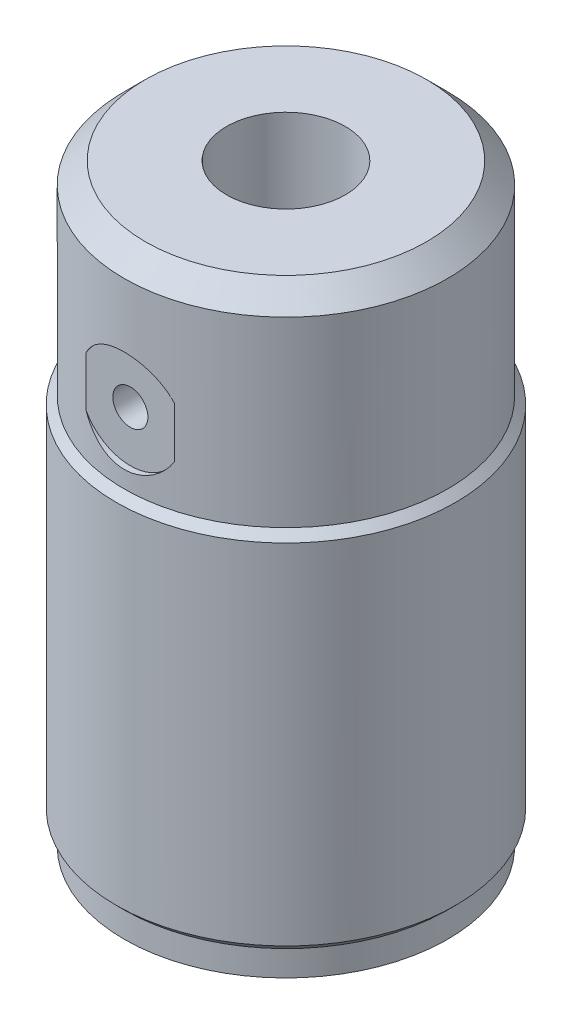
ISO-10303-21;
HEADER;
FILE_DESCRIPTION(('STEP AP214'),'2;1');
FILE_NAME('part.step','',(''),(''),'','','');
FILE_SCHEMA(('AUTOMOTIVE_DESIGN { 1 0 10303 214 1 1 1 1 }'));
ENDSEC;
DATA;
#1=APPLICATION_CONTEXT('core data for automotive mechanical design processes');
#2=APPLICATION_PROTOCOL_DEFINITION('international standard','automotive_design',2000,#1);
#3=PRODUCT_CONTEXT('',#1,'mechanical');
#4=PRODUCT('Part','Part','',(#3));
#5=PRODUCT_RELATED_PRODUCT_CATEGORY('part','',(#4));
#6=PRODUCT_DEFINITION_FORMATION('','',#4);
#7=PRODUCT_DEFINITION_CONTEXT('part definition',#1,'design');
#8=PRODUCT_DEFINITION('design','',#6,#7);
#9=PRODUCT_DEFINITION_SHAPE('','',#8);
#10=(LENGTH_UNIT() NAMED_UNIT(*) SI_UNIT(.MILLI.,.METRE.));
#11=(NAMED_UNIT(*) PLANE_ANGLE_UNIT() SI_UNIT($,.RADIAN.));
#12=(NAMED_UNIT(*) SI_UNIT($,.STERADIAN.) SOLID_ANGLE_UNIT());
#13=UNCERTAINTY_MEASURE_WITH_UNIT(LENGTH_MEASURE(1.E-05),#10,'distance_accuracy_value','');
#14=(GEOMETRIC_REPRESENTATION_CONTEXT(3) GLOBAL_UNCERTAINTY_ASSIGNED_CONTEXT((#13)) GLOBAL_UNIT_ASSIGNED_CONTEXT((#10,
#11,#12)) REPRESENTATION_CONTEXT('',''));
#15=CARTESIAN_POINT('',(0.,0.,0.));
#16=DIRECTION('',(0.,0.,1.));
#17=DIRECTION('',(1.,0.,0.));
#18=AXIS2_PLACEMENT_3D('',#15,#16,#17);
#19=CARTESIAN_POINT('',(0.,34.,0.));
#20=DIRECTION('',(0.,1.,0.));
#21=DIRECTION('',(0.,0.,1.));
#22=AXIS2_PLACEMENT_3D('',#19,#20,#21);
#23=PLANE('',#22);
#24=DIRECTION('',(1.,0.,0.));
#25=VECTOR('',#24,1.);
#26=CARTESIAN_POINT('',(8.,34.,10.));
#27=LINE('',#26,#25);
#28=CARTESIAN_POINT('',(7.5,34.,10.));
#29=VERTEX_POINT('',#28);
#30=CARTESIAN_POINT('',(-7.5,34.,10.));
#31=VERTEX_POINT('',#30);
#32=EDGE_CURVE('E68',#29,#31,#27,.F.);
#33=ORIENTED_EDGE('',*,*,#32,.T.);
#34=CARTESIAN_POINT('',(0.,34.,0.));
#35=DIRECTION('',(0.,1.,0.));
#36=DIRECTION('',(0.,0.,1.));
#37=AXIS2_PLACEMENT_3D('',#34,#35,#36);
#38=CIRCLE('',#37,12.5);
#39=EDGE_CURVE('E19',#31,#29,#38,.T.);
#40=ORIENTED_EDGE('',*,*,#39,.T.);
#41=EDGE_LOOP('',(#33,#40));
#42=FACE_BOUND('',#41,.T.);
#43=ADVANCED_FACE('F16',(#42),#23,.T.);
#44=CARTESIAN_POINT('',(12.5,15.,0.));
#45=DIRECTION('',(0.,1.,0.));
#46=DIRECTION('',(0.,0.,1.));
#47=AXIS2_PLACEMENT_3D('',#44,#45,#46);
#48=PLANE('',#47);
#49=CARTESIAN_POINT('',(0.,15.,0.));
#50=DIRECTION('',(0.,1.,0.));
#51=DIRECTION('',(0.,0.,1.));
#52=AXIS2_PLACEMENT_3D('',#49,#50,#51);
#53=CIRCLE('',#52,12.5);
#54=CARTESIAN_POINT('',(7.5,15.,10.));
#55=VERTEX_POINT('',#54);
#56=CARTESIAN_POINT('',(-7.5,15.,10.));
#57=VERTEX_POINT('',#56);
#58=EDGE_CURVE('E84',#55,#57,#53,.T.);
#59=ORIENTED_EDGE('',*,*,#58,.T.);
#60=DIRECTION('',(1.,0.,0.));
#61=VECTOR('',#60,1.);
#62=CARTESIAN_POINT('',(8.,15.,10.));
#63=LINE('',#62,#61);
#64=EDGE_CURVE('E81',#57,#55,#63,.T.);
#65=ORIENTED_EDGE('',*,*,#64,.T.);
#66=EDGE_LOOP('',(#59,#65));
#67=FACE_BOUND('',#66,.T.);
#68=ADVANCED_FACE('F226',(#67),#48,.T.);
#69=CARTESIAN_POINT('',(8.,34.,10.));
#70=DIRECTION('',(0.,0.,1.));
#71=DIRECTION('',(1.,0.,0.));
#72=AXIS2_PLACEMENT_3D('',#69,#70,#71);
#73=PLANE('',#72);
#74=ORIENTED_EDGE('',*,*,#32,.F.);
#75=DIRECTION('',(0.,1.,0.));
#76=VECTOR('',#75,1.);
#77=CARTESIAN_POINT('',(7.5,15.,10.));
#78=LINE('',#77,#76);
#79=EDGE_CURVE('E74',#29,#55,#78,.F.);
#80=ORIENTED_EDGE('',*,*,#79,.T.);
#81=ORIENTED_EDGE('',*,*,#64,.F.);
#82=DIRECTION('',(0.,1.,0.));
#83=VECTOR('',#82,1.);
#84=CARTESIAN_POINT('',(-7.5,15.,10.));
#85=LINE('',#84,#83);
#86=EDGE_CURVE('E80',#57,#31,#85,.T.);
#87=ORIENTED_EDGE('',*,*,#86,.T.);
#88=EDGE_LOOP('',(#74,#80,#81,#87));
#89=FACE_BOUND('',#88,.T.);
#90=ADVANCED_FACE('F77',(#89),#73,.F.);
#91=CARTESIAN_POINT('',(10.,43.,8.));
#92=DIRECTION('',(0.,1.,0.));
#93=DIRECTION('',(0.,0.,1.));
#94=AXIS2_PLACEMENT_3D('',#91,#92,#93);
#95=PLANE('',#94);
#96=DIRECTION('',(0.,0.,-1.));
#97=VECTOR('',#96,1.);
#98=CARTESIAN_POINT('',(10.,43.,8.));
#99=LINE('',#98,#97);
#100=CARTESIAN_POINT('',(10.,43.,7.5));
#101=VERTEX_POINT('',#100);
#102=CARTESIAN_POINT('',(10.,43.,-7.5));
#103=VERTEX_POINT('',#102);
#104=EDGE_CURVE('E88',#101,#103,#99,.T.);
#105=ORIENTED_EDGE('',*,*,#104,.T.);
#106=CARTESIAN_POINT('',(0.,43.,0.));
#107=DIRECTION('',(0.,1.,0.));
#108=DIRECTION('',(0.,0.,1.));
#109=AXIS2_PLACEMENT_3D('',#106,#107,#108);
#110=CIRCLE('',#109,12.5);
#111=EDGE_CURVE('E91',#103,#101,#110,.F.);
#112=ORIENTED_EDGE('',*,*,#111,.T.);
#113=EDGE_LOOP('',(#105,#112));
#114=FACE_BOUND('',#113,.T.);
#115=ADVANCED_FACE('F200',(#114),#95,.F.);
#116=CARTESIAN_POINT('',(0.,15.,0.));
#117=DIRECTION('',(0.,1.,0.));
#118=DIRECTION('',(0.,0.,1.));
#119=AXIS2_PLACEMENT_3D('',#116,#117,#118);
#120=CYLINDRICAL_SURFACE('',#119,12.5);
#121=ORIENTED_EDGE('',*,*,#111,.F.);
#122=DIRECTION('',(0.,1.,0.));
#123=VECTOR('',#122,1.);
#124=CARTESIAN_POINT('',(10.,48.,-7.5));
#125=LINE('',#124,#123);
#126=CARTESIAN_POINT('',(10.,48.,-7.5));
#127=VERTEX_POINT('',#126);
#128=EDGE_CURVE('E185',#103,#127,#125,.T.);
#129=ORIENTED_EDGE('',*,*,#128,.T.);
#130=CARTESIAN_POINT('',(0.,48.,0.));
#131=DIRECTION('',(0.,1.,0.));
#132=DIRECTION('',(0.,0.,1.));
#133=AXIS2_PLACEMENT_3D('',#130,#131,#132);
#134=CIRCLE('',#133,12.5);
#135=CARTESIAN_POINT('',(10.,48.,7.5));
#136=VERTEX_POINT('',#135);
#137=EDGE_CURVE('E184',#136,#127,#134,.F.);
#138=ORIENTED_EDGE('',*,*,#137,.F.);
#139=DIRECTION('',(0.,1.,0.));
#140=VECTOR('',#139,1.);
#141=CARTESIAN_POINT('',(10.,48.,7.5));
#142=LINE('',#141,#140);
#143=EDGE_CURVE('E186',#136,#101,#142,.F.);
#144=ORIENTED_EDGE('',*,*,#143,.T.);
#145=EDGE_LOOP('',(#121,#129,#138,#144));
#146=FACE_BOUND('',#145,.T.);
#147=ORIENTED_EDGE('',*,*,#58,.F.);
#148=ORIENTED_EDGE('',*,*,#79,.F.);
#149=ORIENTED_EDGE('',*,*,#39,.F.);
#150=ORIENTED_EDGE('',*,*,#86,.F.);
#151=EDGE_LOOP('',(#147,#148,#149,#150));
#152=FACE_BOUND('',#151,.T.);
#153=ADVANCED_FACE('F83',(#146,#152),#120,.F.);
#154=CARTESIAN_POINT('',(10.,48.,8.));
#155=DIRECTION('',(1.,0.,0.));
#156=DIRECTION('',(0.,0.,-1.));
#157=AXIS2_PLACEMENT_3D('',#154,#155,#156);
#158=PLANE('',#157);
#159=DIRECTION('',(0.,0.,-1.));
#160=VECTOR('',#159,1.);
#161=CARTESIAN_POINT('',(10.,48.,0.));
#162=LINE('',#161,#160);
#163=EDGE_CURVE('E181',#127,#136,#162,.F.);
#164=ORIENTED_EDGE('',*,*,#163,.F.);
#165=ORIENTED_EDGE('',*,*,#128,.F.);
#166=ORIENTED_EDGE('',*,*,#104,.F.);
#167=ORIENTED_EDGE('',*,*,#143,.F.);
#168=EDGE_LOOP('',(#164,#165,#166,#167));
#169=FACE_BOUND('',#168,.T.);
#170=ADVANCED_FACE('F204',(#169),#158,.F.);
#171=CARTESIAN_POINT('',(7.,48.,0.));
#172=DIRECTION('',(0.,-1.,0.));
#173=DIRECTION('',(0.,0.,-1.));
#174=AXIS2_PLACEMENT_3D('',#171,#172,#173);
#175=PLANE('',#174);
#176=CARTESIAN_POINT('',(0.,48.,0.));
#177=DIRECTION('',(0.,1.,0.));
#178=DIRECTION('',(0.,0.,1.));
#179=AXIS2_PLACEMENT_3D('',#176,#177,#178);
#180=CIRCLE('',#179,7.);
#181=CARTESIAN_POINT('',(0.,48.,7.));
#182=VERTEX_POINT('',#181);
#183=EDGE_CURVE('E178',#182,#182,#180,.T.);
#184=ORIENTED_EDGE('',*,*,#183,.T.);
#185=EDGE_LOOP('',(#184));
#186=FACE_BOUND('',#185,.T.);
#187=ORIENTED_EDGE('',*,*,#137,.T.);
#188=ORIENTED_EDGE('',*,*,#163,.T.);
#189=EDGE_LOOP('',(#187,#188));
#190=FACE_BOUND('',#189,.T.);
#191=ADVANCED_FACE('F205',(#186,#190),#175,.T.);
#192=CARTESIAN_POINT('',(0.,12.9999999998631,8.9));
#193=DIRECTION('',(0.,-1.,0.));
#194=DIRECTION('',(1.,0.,0.));
#195=AXIS2_PLACEMENT_3D('',#192,#193,#194);
#196=CONICAL_SURFACE('',#195,2.06700000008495,1.02974425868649);
#197=CARTESIAN_POINT('',(0.,14.2419788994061,8.89999999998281));
#198=VERTEX_POINT('',#197);
#199=VERTEX_LOOP('',#198);
#200=FACE_BOUND('',#199,.T.);
#201=CARTESIAN_POINT('',(0.,13.,8.9));
#202=DIRECTION('',(0.,-1.,0.));
#203=DIRECTION('',(0.,0.,-1.));
#204=AXIS2_PLACEMENT_3D('',#201,#202,#203);
#205=CIRCLE('',#204,2.067);
#206=CARTESIAN_POINT('',(0.,13.,6.833));
#207=VERTEX_POINT('',#206);
#208=EDGE_CURVE('E174',#207,#207,#205,.T.);
#209=ORIENTED_EDGE('',*,*,#208,.T.);
#210=EDGE_LOOP('',(#209));
#211=FACE_BOUND('',#210,.T.);
#212=ADVANCED_FACE('F207',(#200,#211),#196,.F.);
#213=CARTESIAN_POINT('',(0.,15.,0.));
#214=DIRECTION('',(0.,1.,0.));
#215=DIRECTION('',(0.,0.,1.));
#216=AXIS2_PLACEMENT_3D('',#213,#214,#215);
#217=CYLINDRICAL_SURFACE('',#216,7.);
#218=CARTESIAN_POINT('',(2.0568481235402,53.7953911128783,6.69099213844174));
#219=CARTESIAN_POINT('',(2.04550856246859,53.6814208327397,6.69447882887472));
#220=CARTESIAN_POINT('',(2.02467489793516,53.5684624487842,6.70087190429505));
#221=CARTESIAN_POINT('',(1.964766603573,53.3478805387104,6.71867937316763));
#222=CARTESIAN_POINT('',(1.92568222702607,53.2402598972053,6.73009644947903));
#223=CARTESIAN_POINT('',(1.83064782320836,53.0334896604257,6.75656305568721));
#224=CARTESIAN_POINT('',(1.77472851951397,52.9343250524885,6.77160595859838));
#225=CARTESIAN_POINT('',(1.64759935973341,52.7467036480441,6.8036535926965));
#226=CARTESIAN_POINT('',(1.57638822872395,52.6582477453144,6.82065848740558));
#227=CARTESIAN_POINT('',(1.41827897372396,52.4918514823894,6.85530483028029));
#228=CARTESIAN_POINT('',(1.33099480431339,52.4142784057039,6.87295069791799));
#229=CARTESIAN_POINT('',(1.14439754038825,52.2747717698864,6.9064699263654));
#230=CARTESIAN_POINT('',(1.04508412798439,52.2128386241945,6.92234324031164));
#231=CARTESIAN_POINT('',(0.836605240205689,52.1062374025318,6.95062490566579));
#232=CARTESIAN_POINT('',(0.72740254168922,52.0616382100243,6.96301937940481));
#233=CARTESIAN_POINT('',(0.502596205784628,51.9915834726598,6.98284391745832));
#234=CARTESIAN_POINT('',(0.386994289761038,51.9661228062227,6.99027530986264));
#235=CARTESIAN_POINT('',(0.157100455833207,51.9358368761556,6.9991484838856));
#236=CARTESIAN_POINT('',(0.0429088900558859,51.9303079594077,7.00079445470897));
#237=CARTESIAN_POINT('',(-0.184759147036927,51.9381264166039,6.99848690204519));
#238=CARTESIAN_POINT('',(-0.298235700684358,51.9514715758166,6.99453403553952));
#239=CARTESIAN_POINT('',(-0.518938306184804,51.9960985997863,6.98159672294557));
#240=CARTESIAN_POINT('',(-0.626243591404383,52.0270204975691,6.97271333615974));
#241=CARTESIAN_POINT('',(-0.834134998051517,52.1055190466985,6.95091027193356));
#242=CARTESIAN_POINT('',(-0.934720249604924,52.1530978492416,6.93799007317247));
#243=CARTESIAN_POINT('',(-1.1290347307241,52.2648805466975,6.90906453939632));
#244=CARTESIAN_POINT('',(-1.22253608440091,52.3294626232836,6.89299147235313));
#245=CARTESIAN_POINT('',(-1.39761380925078,52.4729178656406,6.8596378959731));
#246=CARTESIAN_POINT('',(-1.47918729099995,52.5517944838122,6.84235709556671));
#247=CARTESIAN_POINT('',(-1.63097136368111,52.7248098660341,6.80780483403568));
#248=CARTESIAN_POINT('',(-1.70069787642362,52.8193783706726,6.79055390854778));
#249=CARTESIAN_POINT('',(-1.82330075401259,53.0192818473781,6.75866871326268));
#250=CARTESIAN_POINT('',(-1.8761780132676,53.1246162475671,6.74403430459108));
#251=CARTESIAN_POINT('',(-1.9630736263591,53.3423789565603,6.71925454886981));
#252=CARTESIAN_POINT('',(-1.99723168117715,53.4547475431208,6.70907606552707));
#253=CARTESIAN_POINT('',(-2.04605658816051,53.6839882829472,6.69434961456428));
#254=CARTESIAN_POINT('',(-2.06072980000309,53.8008589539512,6.68979980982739));
#255=CARTESIAN_POINT('',(-2.0698398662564,54.0306997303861,6.68698585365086));
#256=CARTESIAN_POINT('',(-2.06507284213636,54.1436359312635,6.6884744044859));
#257=CARTESIAN_POINT('',(-2.03726716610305,54.367013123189,6.69699557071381));
#258=CARTESIAN_POINT('',(-2.01422888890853,54.4774541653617,6.70402807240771));
#259=CARTESIAN_POINT('',(-1.95097675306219,54.6917768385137,6.7227043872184));
#260=CARTESIAN_POINT('',(-1.91091928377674,54.795708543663,6.73430614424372));
#261=CARTESIAN_POINT('',(-1.81488400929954,54.9954770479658,6.76081852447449));
#262=CARTESIAN_POINT('',(-1.75890301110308,55.0913122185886,6.77572981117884));
#263=CARTESIAN_POINT('',(-1.63020001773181,55.2759547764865,6.80786269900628));
#264=CARTESIAN_POINT('',(-1.55693934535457,55.3643755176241,6.82514897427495));
#265=CARTESIAN_POINT('',(-1.39680786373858,55.5279130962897,6.85971044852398));
#266=CARTESIAN_POINT('',(-1.30993452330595,55.6030274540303,6.87698564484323));
#267=CARTESIAN_POINT('',(-1.12231196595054,55.739747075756,6.91011637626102));
#268=CARTESIAN_POINT('',(-1.02126165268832,55.800952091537,6.92592355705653));
#269=CARTESIAN_POINT('',(-0.809799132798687,55.9054170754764,6.95381766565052));
#270=CARTESIAN_POINT('',(-0.699388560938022,55.9486801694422,6.96590524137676));
#271=CARTESIAN_POINT('',(-0.47493674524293,56.0150205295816,6.98475664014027));
#272=CARTESIAN_POINT('',(-0.36103312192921,56.038530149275,6.99163414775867));
#273=CARTESIAN_POINT('',(-0.130708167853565,56.0661192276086,6.9997271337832));
#274=CARTESIAN_POINT('',(-0.0142874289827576,56.0702032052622,7.00094392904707));
#275=CARTESIAN_POINT('',(0.213521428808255,56.0589949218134,6.99763888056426));
#276=CARTESIAN_POINT('',(0.324945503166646,56.0443604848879,6.99331185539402));
#277=CARTESIAN_POINT('',(0.543665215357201,55.9973559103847,6.97971628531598));
#278=CARTESIAN_POINT('',(0.65096073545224,55.9649852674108,6.97044759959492));
#279=CARTESIAN_POINT('',(0.85906903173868,55.883360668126,6.94787882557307));
#280=CARTESIAN_POINT('',(0.959847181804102,55.8340241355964,6.93455905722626));
#281=CARTESIAN_POINT('',(1.15184662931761,55.7199462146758,6.90526569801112));
#282=CARTESIAN_POINT('',(1.24306592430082,55.6552016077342,6.88929155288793));
#283=CARTESIAN_POINT('',(1.4169339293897,55.5093478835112,6.85568613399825));
#284=CARTESIAN_POINT('',(1.49914387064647,55.4277243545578,6.83801551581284));
#285=CARTESIAN_POINT('',(1.64889011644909,55.2517976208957,6.80346101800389));
#286=CARTESIAN_POINT('',(1.71642327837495,55.1574917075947,6.78657730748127));
#287=CARTESIAN_POINT('',(1.83589328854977,54.9569837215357,6.75524858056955));
#288=CARTESIAN_POINT('',(1.88756374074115,54.8506156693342,6.7408468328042));
#289=CARTESIAN_POINT('',(1.97211542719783,54.6302059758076,6.71660005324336));
#290=CARTESIAN_POINT('',(2.00500936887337,54.516169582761,6.70675194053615));
#291=CARTESIAN_POINT('',(2.04749925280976,54.3007906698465,6.69388943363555));
#292=CARTESIAN_POINT('',(2.05979142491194,54.2000194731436,6.69008842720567));
#293=CARTESIAN_POINT('',(2.06947769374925,53.9976988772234,6.68709874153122));
#294=CARTESIAN_POINT('',(2.066873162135,53.8961495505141,6.68790963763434));
#295=CARTESIAN_POINT('',(2.0568481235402,53.7953911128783,6.69099213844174));
#296=B_SPLINE_CURVE_WITH_KNOTS('',3,(#218,#219,#220,#221,#222,#223,#224,#225,#226,#227,#228,
#229,#230,#231,#232,#233,#234,#235,#236,#237,#238,#239,#240,#241,#242,#243,#244,#245,#246,#247,
#248,#249,#250,#251,#252,#253,#254,#255,#256,#257,#258,#259,#260,#261,#262,#263,#264,#265,#266,
#267,#268,#269,#270,#271,#272,#273,#274,#275,#276,#277,#278,#279,#280,#281,#282,#283,#284,#285,
#286,#287,#288,#289,#290,#291,#292,#293,#294,#295),.UNSPECIFIED.,.T.,.F.,(4,2,2,2,2,2,2,2,2,2,2,
2,2,2,2,2,2,2,2,2,2,2,2,2,2,2,2,2,2,2,2,2,2,2,2,2,2,2,4),(0.,0.343378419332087,
0.686940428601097,1.02987920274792,1.37284657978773,1.72549451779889,2.07815177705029,
2.43219647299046,2.7861463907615,3.1274712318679,3.46875602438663,3.80329098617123,
4.13786916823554,4.48063108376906,4.82347589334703,5.17804712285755,5.53259952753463,
5.88446857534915,6.23622274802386,6.57371948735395,6.91120930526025,7.24566280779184,
7.58018342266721,7.92697254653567,8.27382623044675,8.62966293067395,8.98543761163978,
9.33320591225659,9.68089330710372,10.0166910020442,10.3524982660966,10.6899636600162,
11.0274996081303,11.3774533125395,11.7274818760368,12.0831023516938,12.438481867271,
12.74208258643,13.0456553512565),.UNSPECIFIED.);
#297=CARTESIAN_POINT('',(2.0568481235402,53.7953911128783,6.69099213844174));
#298=VERTEX_POINT('',#297);
#299=EDGE_CURVE('E395',#298,#298,#296,.F.);
#300=ORIENTED_EDGE('',*,*,#299,.T.);
#301=EDGE_LOOP('',(#300));
#302=FACE_BOUND('',#301,.T.);
#303=CARTESIAN_POINT('',(0.,70.,0.));
#304=DIRECTION('',(0.,1.,0.));
#305=DIRECTION('',(0.,0.,1.));
#306=AXIS2_PLACEMENT_3D('',#303,#304,#305);
#307=CIRCLE('',#306,7.);
#308=CARTESIAN_POINT('',(0.,70.,7.));
#309=VERTEX_POINT('',#308);
#310=EDGE_CURVE('E177',#309,#309,#307,.T.);
#311=ORIENTED_EDGE('',*,*,#310,.T.);
#312=EDGE_LOOP('',(#311));
#313=FACE_BOUND('',#312,.T.);
#314=ORIENTED_EDGE('',*,*,#183,.F.);
#315=EDGE_LOOP('',(#314));
#316=FACE_BOUND('',#315,.T.);
#317=ADVANCED_FACE('F214',(#302,#313,#316),#217,.F.);
#318=CARTESIAN_POINT('',(0.,14.24197889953,8.9));
#319=DIRECTION('',(0.,-1.,0.));
#320=DIRECTION('',(0.,0.,-1.));
#321=AXIS2_PLACEMENT_3D('',#318,#319,#320);
#322=CYLINDRICAL_SURFACE('',#321,2.067);
#323=CARTESIAN_POINT('',(0.,0.,8.9));
#324=DIRECTION('',(0.,-1.,0.));
#325=DIRECTION('',(0.,0.,-1.));
#326=AXIS2_PLACEMENT_3D('',#323,#324,#325);
#327=CIRCLE('',#326,2.067);
#328=CARTESIAN_POINT('',(0.,0.,6.833));
#329=VERTEX_POINT('',#328);
#330=EDGE_CURVE('E402',#329,#329,#327,.T.);
#331=ORIENTED_EDGE('',*,*,#330,.T.);
#332=EDGE_LOOP('',(#331));
#333=FACE_BOUND('',#332,.T.);
#334=ORIENTED_EDGE('',*,*,#208,.F.);
#335=EDGE_LOOP('',(#334));
#336=FACE_BOUND('',#335,.T.);
#337=ADVANCED_FACE('F286',(#333,#336),#322,.F.);
#338=CARTESIAN_POINT('',(0.,70.,0.));
#339=DIRECTION('',(0.,-1.,0.));
#340=DIRECTION('',(0.,0.,-1.));
#341=AXIS2_PLACEMENT_3D('',#338,#339,#340);
#342=PLANE('',#341);
#343=ORIENTED_EDGE('',*,*,#310,.F.);
#344=EDGE_LOOP('',(#343));
#345=FACE_BOUND('',#344,.T.);
#346=CARTESIAN_POINT('',(0.,70.,0.));
#347=DIRECTION('',(0.,-1.,0.));
#348=DIRECTION('',(0.,0.,-1.));
#349=AXIS2_PLACEMENT_3D('',#346,#347,#348);
#350=CIRCLE('',#349,16.58);
#351=CARTESIAN_POINT('',(0.,70.,-16.58));
#352=VERTEX_POINT('',#351);
#353=EDGE_CURVE('E416',#352,#352,#350,.T.);
#354=ORIENTED_EDGE('',*,*,#353,.F.);
#355=EDGE_LOOP('',(#354));
#356=FACE_BOUND('',#355,.T.);
#357=ADVANCED_FACE('F295',(#345,#356),#342,.F.);
#358=CARTESIAN_POINT('',(0.,54.,6.35));
#359=DIRECTION('',(0.,0.,1.));
#360=DIRECTION('',(1.,0.,0.));
#361=AXIS2_PLACEMENT_3D('',#358,#359,#360);
#362=CYLINDRICAL_SURFACE('',#361,2.067);
#363=CARTESIAN_POINT('',(0.,54.,18.35));
#364=DIRECTION('',(0.,0.,1.));
#365=DIRECTION('',(1.,0.,0.));
#366=AXIS2_PLACEMENT_3D('',#363,#364,#365);
#367=CIRCLE('',#366,2.067);
#368=CARTESIAN_POINT('',(2.067,54.,18.35));
#369=VERTEX_POINT('',#368);
#370=EDGE_CURVE('E417',#369,#369,#367,.F.);
#371=ORIENTED_EDGE('',*,*,#370,.F.);
#372=EDGE_LOOP('',(#371));
#373=FACE_BOUND('',#372,.T.);
#374=ORIENTED_EDGE('',*,*,#299,.F.);
#375=EDGE_LOOP('',(#374));
#376=FACE_BOUND('',#375,.T.);
#377=ADVANCED_FACE('F305',(#373,#376),#362,.F.);
#378=CARTESIAN_POINT('',(19.08,0.,0.));
#379=DIRECTION('',(0.,1.,0.));
#380=DIRECTION('',(0.,0.,1.));
#381=AXIS2_PLACEMENT_3D('',#378,#379,#380);
#382=PLANE('',#381);
#383=CARTESIAN_POINT('',(0.,0.,0.));
#384=DIRECTION('',(0.,1.,0.));
#385=DIRECTION('',(0.,0.,1.));
#386=AXIS2_PLACEMENT_3D('',#383,#384,#385);
#387=CIRCLE('',#386,19.08);
#388=CARTESIAN_POINT('',(0.,0.,19.08));
#389=VERTEX_POINT('',#388);
#390=EDGE_CURVE('E171',#389,#389,#387,.T.);
#391=ORIENTED_EDGE('',*,*,#390,.F.);
#392=EDGE_LOOP('',(#391));
#393=FACE_BOUND('',#392,.T.);
#394=ORIENTED_EDGE('',*,*,#330,.F.);
#395=EDGE_LOOP('',(#394));
#396=FACE_BOUND('',#395,.T.);
#397=ADVANCED_FACE('F315',(#393,#396),#382,.F.);
#398=CARTESIAN_POINT('',(0.,67.5000000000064,0.));
#399=DIRECTION('',(0.,-1.,0.));
#400=DIRECTION('',(0.,0.,-1.));
#401=AXIS2_PLACEMENT_3D('',#398,#399,#400);
#402=CONICAL_SURFACE('',#401,19.0800000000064,0.7853981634);
#403=ORIENTED_EDGE('',*,*,#353,.T.);
#404=EDGE_LOOP('',(#403));
#405=FACE_BOUND('',#404,.T.);
#406=CARTESIAN_POINT('',(0.,67.5,0.));
#407=DIRECTION('',(0.,1.,0.));
#408=DIRECTION('',(0.,0.,1.));
#409=AXIS2_PLACEMENT_3D('',#406,#407,#408);
#410=CIRCLE('',#409,19.08);
#411=CARTESIAN_POINT('',(0.,67.5,19.08));
#412=VERTEX_POINT('',#411);
#413=EDGE_CURVE('E168',#412,#412,#410,.F.);
#414=ORIENTED_EDGE('',*,*,#413,.F.);
#415=EDGE_LOOP('',(#414));
#416=FACE_BOUND('',#415,.T.);
#417=ADVANCED_FACE('F325',(#405,#416),#402,.T.);
#418=CARTESIAN_POINT('',(0.,54.,6.35));
#419=DIRECTION('',(0.,0.,1.));
#420=DIRECTION('',(1.,0.,0.));
#421=AXIS2_PLACEMENT_3D('',#418,#419,#420);
#422=CYLINDRICAL_SURFACE('',#421,6.);
#423=CARTESIAN_POINT('',(0.,54.,18.35));
#424=DIRECTION('',(0.,0.,1.));
#425=DIRECTION('',(1.,0.,0.));
#426=AXIS2_PLACEMENT_3D('',#423,#424,#425);
#427=CIRCLE('',#426,6.);
#428=CARTESIAN_POINT('',(5.22722679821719,56.9455220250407,18.35));
#429=VERTEX_POINT('',#428);
#430=CARTESIAN_POINT('',(-5.2272267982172,56.9455220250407,18.35));
#431=VERTEX_POINT('',#430);
#432=EDGE_CURVE('E420',#429,#431,#427,.T.);
#433=ORIENTED_EDGE('',*,*,#432,.F.);
#434=CARTESIAN_POINT('',(-5.22722679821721,56.9455220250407,18.35));
#435=CARTESIAN_POINT('',(-5.14348691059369,57.0941546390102,18.3738518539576));
#436=CARTESIAN_POINT('',(-5.0534750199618,57.2390482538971,18.3988760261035));
#437=CARTESIAN_POINT('',(-4.86161853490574,57.5204576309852,18.4505000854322));
#438=CARTESIAN_POINT('',(-4.75977529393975,57.6569743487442,18.4770997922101));
#439=CARTESIAN_POINT('',(-4.5449140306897,57.9208061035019,18.5311203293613));
#440=CARTESIAN_POINT('',(-4.4318924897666,58.0481182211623,18.5585414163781));
#441=CARTESIAN_POINT('',(-4.19544904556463,58.2926837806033,18.6134181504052));
#442=CARTESIAN_POINT('',(-4.07202697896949,58.4099370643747,18.6408737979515));
#443=CARTESIAN_POINT('',(-3.81555548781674,58.633626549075,18.6950558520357));
#444=CARTESIAN_POINT('',(-3.68250454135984,58.7400610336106,18.7217821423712));
#445=CARTESIAN_POINT('',(-3.40759477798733,58.9413898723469,18.7737654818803));
#446=CARTESIAN_POINT('',(-3.26573294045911,59.0362802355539,18.7990220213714));
#447=CARTESIAN_POINT('',(-2.97425041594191,59.2137250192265,18.8473351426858));
#448=CARTESIAN_POINT('',(-2.82463436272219,59.2962866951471,18.8703930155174));
#449=CARTESIAN_POINT('',(-2.51857541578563,59.4484845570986,18.913673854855));
#450=CARTESIAN_POINT('',(-2.36213281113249,59.518121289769,18.933896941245));
#451=CARTESIAN_POINT('',(-2.04532472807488,59.6431654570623,18.9707191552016));
#452=CARTESIAN_POINT('',(-1.88502407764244,59.6987256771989,18.9873568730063));
#453=CARTESIAN_POINT('',(-1.56002777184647,59.7961261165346,19.0168168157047));
#454=CARTESIAN_POINT('',(-1.39533382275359,59.8379715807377,19.0296404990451));
#455=CARTESIAN_POINT('',(-1.0627092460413,59.9075818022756,19.051110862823));
#456=CARTESIAN_POINT('',(-0.894778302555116,59.9353451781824,19.0597571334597));
#457=CARTESIAN_POINT('',(-0.556998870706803,59.9765120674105,19.0726168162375));
#458=CARTESIAN_POINT('',(-0.387150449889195,59.9899160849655,19.0768303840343));
#459=CARTESIAN_POINT('',(-0.0540722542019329,60.0019717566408,19.0806193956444));
#460=CARTESIAN_POINT('',(0.10913399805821,60.0012227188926,19.0803832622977));
#461=CARTESIAN_POINT('',(0.434940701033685,59.9864368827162,19.075737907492));
#462=CARTESIAN_POINT('',(0.59754092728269,59.9723955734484,19.0713272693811));
#463=CARTESIAN_POINT('',(0.920813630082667,59.9311584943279,19.0584537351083));
#464=CARTESIAN_POINT('',(1.08148706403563,59.9039695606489,19.0499929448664));
#465=CARTESIAN_POINT('',(1.3999104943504,59.8366720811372,19.0292437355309));
#466=CARTESIAN_POINT('',(1.55765943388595,59.7965589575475,19.0169539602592));
#467=CARTESIAN_POINT('',(1.86775665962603,59.704159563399,18.988994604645));
#468=CARTESIAN_POINT('',(2.02013963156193,59.651980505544,18.9733548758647));
#469=CARTESIAN_POINT('',(2.31992708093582,59.53568327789,18.939036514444));
#470=CARTESIAN_POINT('',(2.46733141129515,59.4715647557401,18.9203577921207));
#471=CARTESIAN_POINT('',(2.7563369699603,59.3318277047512,18.8804211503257));
#472=CARTESIAN_POINT('',(2.89793435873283,59.2562017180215,18.859161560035));
#473=CARTESIAN_POINT('',(3.17434014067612,59.0940389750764,18.8146102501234));
#474=CARTESIAN_POINT('',(3.30915047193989,59.0075053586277,18.7913191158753));
#475=CARTESIAN_POINT('',(3.57620461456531,58.820613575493,18.7423658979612));
#476=CARTESIAN_POINT('',(3.70815921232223,58.7198567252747,18.716647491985));
#477=CARTESIAN_POINT('',(3.96312467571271,58.5078950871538,18.6643236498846));
#478=CARTESIAN_POINT('',(4.08613845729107,58.396693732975,18.637718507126));
#479=CARTESIAN_POINT('',(4.32240468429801,58.1646380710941,18.5843448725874));
#480=CARTESIAN_POINT('',(4.43566678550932,58.0437935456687,18.557576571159));
#481=CARTESIAN_POINT('',(4.65182567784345,57.7931370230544,18.5045750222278));
#482=CARTESIAN_POINT('',(4.75472717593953,57.6633291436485,18.4783415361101));
#483=CARTESIAN_POINT('',(4.92019708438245,57.4358485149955,18.4348316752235));
#484=CARTESIAN_POINT('',(4.98557991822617,57.3402698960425,18.4172368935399));
#485=CARTESIAN_POINT('',(5.1106710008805,57.1455390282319,18.3829168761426));
#486=CARTESIAN_POINT('',(5.17038813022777,57.0463927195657,18.3661902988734));
#487=CARTESIAN_POINT('',(5.22722679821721,56.9455220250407,18.35));
#488=B_SPLINE_CURVE_WITH_KNOTS('',3,(#434,#435,#436,#437,#438,#439,#440,#441,#442,#443,#444,
#445,#446,#447,#448,#449,#450,#451,#452,#453,#454,#455,#456,#457,#458,#459,#460,#461,#462,#463,
#464,#465,#466,#467,#468,#469,#470,#471,#472,#473,#474,#475,#476,#477,#478,#479,#480,#481,#482,
#483,#484,#485,#486,#487),.UNSPECIFIED.,.F.,.F.,(4,2,2,2,2,2,2,2,2,2,2,2,2,2,2,2,2,2,2,2,2,2,2,
2,2,2,4),(0.,0.516596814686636,1.03313459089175,1.54983548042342,2.06654448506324,
2.58333533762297,3.10030434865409,3.61696791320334,4.13360962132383,4.64437707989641,
5.1549489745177,5.6655709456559,6.1761749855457,6.66520796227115,7.15440695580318,
7.64335186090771,8.13247014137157,8.61739885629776,9.10234188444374,9.58760054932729,
10.072719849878,10.5761605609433,11.0794363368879,11.5822079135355,12.084750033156,
12.4359605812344,12.7866112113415),.UNSPECIFIED.);
#489=EDGE_CURVE('E104',#431,#429,#488,.T.);
#490=ORIENTED_EDGE('',*,*,#489,.F.);
#491=EDGE_LOOP('',(#433,#490));
#492=FACE_BOUND('',#491,.T.);
#493=ADVANCED_FACE('F335',(#492),#422,.F.);
#494=CARTESIAN_POINT('',(0.,60.,18.35));
#495=DIRECTION('',(0.,0.,1.));
#496=DIRECTION('',(1.,0.,0.));
#497=AXIS2_PLACEMENT_3D('',#494,#495,#496);
#498=PLANE('',#497);
#499=DIRECTION('',(0.,1.,0.));
#500=VECTOR('',#499,1.);
#501=CARTESIAN_POINT('',(5.22722679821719,0.,18.35));
#502=LINE('',#501,#500);
#503=CARTESIAN_POINT('',(5.2272267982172,51.0544779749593,18.35));
#504=VERTEX_POINT('',#503);
#505=EDGE_CURVE('E103',#429,#504,#502,.F.);
#506=ORIENTED_EDGE('',*,*,#505,.F.);
#507=ORIENTED_EDGE('',*,*,#432,.T.);
#508=DIRECTION('',(0.,1.,0.));
#509=VECTOR('',#508,1.);
#510=CARTESIAN_POINT('',(-5.2272267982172,0.,18.35));
#511=LINE('',#510,#509);
#512=CARTESIAN_POINT('',(-5.22722679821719,51.0544779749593,18.35));
#513=VERTEX_POINT('',#512);
#514=EDGE_CURVE('E165',#513,#431,#511,.T.);
#515=ORIENTED_EDGE('',*,*,#514,.F.);
#516=CARTESIAN_POINT('',(0.,54.,18.35));
#517=DIRECTION('',(0.,0.,1.));
#518=DIRECTION('',(1.,0.,0.));
#519=AXIS2_PLACEMENT_3D('',#516,#517,#518);
#520=CIRCLE('',#519,6.);
#521=EDGE_CURVE('E34',#513,#504,#520,.T.);
#522=ORIENTED_EDGE('',*,*,#521,.T.);
#523=EDGE_LOOP('',(#506,#507,#515,#522));
#524=FACE_BOUND('',#523,.T.);
#525=ORIENTED_EDGE('',*,*,#370,.T.);
#526=EDGE_LOOP('',(#525));
#527=FACE_BOUND('',#526,.T.);
#528=ADVANCED_FACE('F130',(#524,#527),#498,.T.);
#529=CARTESIAN_POINT('',(0.,54.,6.35));
#530=DIRECTION('',(0.,0.,1.));
#531=DIRECTION('',(1.,0.,0.));
#532=AXIS2_PLACEMENT_3D('',#529,#530,#531);
#533=CYLINDRICAL_SURFACE('',#532,6.);
#534=ORIENTED_EDGE('',*,*,#521,.F.);
#535=CARTESIAN_POINT('',(5.22722679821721,51.0544779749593,18.35));
#536=CARTESIAN_POINT('',(5.14348691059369,50.9058453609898,18.3738518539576));
#537=CARTESIAN_POINT('',(5.0534750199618,50.7609517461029,18.3988760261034));
#538=CARTESIAN_POINT('',(4.86161853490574,50.4795423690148,18.4505000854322));
#539=CARTESIAN_POINT('',(4.75977529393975,50.3430256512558,18.4770997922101));
#540=CARTESIAN_POINT('',(4.5449140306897,50.0791938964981,18.5311203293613));
#541=CARTESIAN_POINT('',(4.4318924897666,49.9518817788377,18.5585414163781));
#542=CARTESIAN_POINT('',(4.19544904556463,49.7073162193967,18.6134181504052));
#543=CARTESIAN_POINT('',(4.07202697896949,49.5900629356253,18.6408737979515));
#544=CARTESIAN_POINT('',(3.81555548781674,49.366373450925,18.6950558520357));
#545=CARTESIAN_POINT('',(3.68250454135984,49.2599389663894,18.7217821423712));
#546=CARTESIAN_POINT('',(3.40759477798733,49.0586101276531,18.7737654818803));
#547=CARTESIAN_POINT('',(3.26573294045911,48.9637197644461,18.7990220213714));
#548=CARTESIAN_POINT('',(2.9742504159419,48.7862749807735,18.8473351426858));
#549=CARTESIAN_POINT('',(2.82463436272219,48.7037133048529,18.8703930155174));
#550=CARTESIAN_POINT('',(2.51857541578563,48.5515154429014,18.913673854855));
#551=CARTESIAN_POINT('',(2.36213281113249,48.481878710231,18.933896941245));
#552=CARTESIAN_POINT('',(2.04532472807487,48.3568345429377,18.9707191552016));
#553=CARTESIAN_POINT('',(1.88502407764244,48.3012743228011,18.9873568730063));
#554=CARTESIAN_POINT('',(1.56002777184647,48.2038738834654,19.0168168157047));
#555=CARTESIAN_POINT('',(1.39533382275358,48.1620284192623,19.0296404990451));
#556=CARTESIAN_POINT('',(1.06270924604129,48.0924181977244,19.051110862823));
#557=CARTESIAN_POINT('',(0.894778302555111,48.0646548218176,19.0597571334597));
#558=CARTESIAN_POINT('',(0.556998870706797,48.0234879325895,19.0726168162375));
#559=CARTESIAN_POINT('',(0.387150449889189,48.0100839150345,19.0768303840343));
#560=CARTESIAN_POINT('',(0.0540722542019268,47.9980282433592,19.0806193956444));
#561=CARTESIAN_POINT('',(-0.109133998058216,47.9987772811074,19.0803832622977));
#562=CARTESIAN_POINT('',(-0.434940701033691,48.0135631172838,19.075737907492));
#563=CARTESIAN_POINT('',(-0.597540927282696,48.0276044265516,19.0713272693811));
#564=CARTESIAN_POINT('',(-0.920813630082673,48.0688415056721,19.0584537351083));
#565=CARTESIAN_POINT('',(-1.08148706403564,48.0960304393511,19.0499929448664));
#566=CARTESIAN_POINT('',(-1.39991049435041,48.1633279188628,19.0292437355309));
#567=CARTESIAN_POINT('',(-1.55765943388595,48.2034410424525,19.0169539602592));
#568=CARTESIAN_POINT('',(-1.86775665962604,48.295840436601,18.988994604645));
#569=CARTESIAN_POINT('',(-2.02013963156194,48.348019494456,18.9733548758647));
#570=CARTESIAN_POINT('',(-2.31992708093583,48.46431672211,18.939036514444));
#571=CARTESIAN_POINT('',(-2.46733141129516,48.5284352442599,18.9203577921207));
#572=CARTESIAN_POINT('',(-2.75633696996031,48.6681722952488,18.8804211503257));
#573=CARTESIAN_POINT('',(-2.89793435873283,48.7437982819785,18.859161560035));
#574=CARTESIAN_POINT('',(-3.17434014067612,48.9059610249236,18.8146102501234));
#575=CARTESIAN_POINT('',(-3.3091504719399,48.9924946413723,18.7913191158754));
#576=CARTESIAN_POINT('',(-3.57620461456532,49.179386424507,18.7423658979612));
#577=CARTESIAN_POINT('',(-3.70815921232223,49.2801432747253,18.716647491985));
#578=CARTESIAN_POINT('',(-3.96312467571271,49.4921049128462,18.6643236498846));
#579=CARTESIAN_POINT('',(-4.08613845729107,49.603306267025,18.637718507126));
#580=CARTESIAN_POINT('',(-4.32240468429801,49.835361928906,18.5843448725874));
#581=CARTESIAN_POINT('',(-4.43566678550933,49.9562064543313,18.557576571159));
#582=CARTESIAN_POINT('',(-4.65182567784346,50.2068629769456,18.5045750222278));
#583=CARTESIAN_POINT('',(-4.75472717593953,50.3366708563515,18.4783415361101));
#584=CARTESIAN_POINT('',(-4.92019708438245,50.5641514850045,18.4348316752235));
#585=CARTESIAN_POINT('',(-4.98557991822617,50.6597301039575,18.4172368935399));
#586=CARTESIAN_POINT('',(-5.1106710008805,50.8544609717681,18.3829168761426));
#587=CARTESIAN_POINT('',(-5.17038813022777,50.9536072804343,18.3661902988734));
#588=CARTESIAN_POINT('',(-5.22722679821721,51.0544779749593,18.35));
#589=B_SPLINE_CURVE_WITH_KNOTS('',3,(#535,#536,#537,#538,#539,#540,#541,#542,#543,#544,#545,
#546,#547,#548,#549,#550,#551,#552,#553,#554,#555,#556,#557,#558,#559,#560,#561,#562,#563,#564,
#565,#566,#567,#568,#569,#570,#571,#572,#573,#574,#575,#576,#577,#578,#579,#580,#581,#582,#583,
#584,#585,#586,#587,#588),.UNSPECIFIED.,.F.,.F.,(4,2,2,2,2,2,2,2,2,2,2,2,2,2,2,2,2,2,2,2,2,2,2,
2,2,2,4),(0.,0.516596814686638,1.03313459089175,1.54983548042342,2.06654448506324,
2.58333533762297,3.10030434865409,3.61696791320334,4.13360962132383,4.64437707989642,
5.15494897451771,5.66557094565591,6.1761749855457,6.66520796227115,7.15440695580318,
7.64335186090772,8.13247014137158,8.61739885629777,9.10234188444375,9.58760054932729,
10.0727198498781,10.5761605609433,11.0794363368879,11.5822079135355,12.084750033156,
12.4359605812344,12.7866112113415),.UNSPECIFIED.);
#590=EDGE_CURVE('E93',#504,#513,#589,.T.);
#591=ORIENTED_EDGE('',*,*,#590,.F.);
#592=EDGE_LOOP('',(#534,#591));
#593=FACE_BOUND('',#592,.T.);
#594=ADVANCED_FACE('F111',(#593),#533,.F.);
#595=CARTESIAN_POINT('',(0.,0.,0.));
#596=DIRECTION('',(0.,1.,0.));
#597=DIRECTION('',(0.,0.,1.));
#598=AXIS2_PLACEMENT_3D('',#595,#596,#597);
#599=CYLINDRICAL_SURFACE('',#598,19.08);
#600=CARTESIAN_POINT('',(0.,3.00000000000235,0.));
#601=DIRECTION('',(0.,1.,0.));
#602=DIRECTION('',(0.,0.,1.));
#603=AXIS2_PLACEMENT_3D('',#600,#601,#602);
#604=CIRCLE('',#603,19.0799999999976);
#605=CARTESIAN_POINT('',(0.,3.00000000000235,19.0799999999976));
#606=VERTEX_POINT('',#605);
#607=EDGE_CURVE('E102',#606,#606,#604,.T.);
#608=ORIENTED_EDGE('',*,*,#607,.F.);
#609=EDGE_LOOP('',(#608));
#610=FACE_BOUND('',#609,.T.);
#611=ORIENTED_EDGE('',*,*,#390,.T.);
#612=EDGE_LOOP('',(#611));
#613=FACE_BOUND('',#612,.T.);
#614=ADVANCED_FACE('F120',(#610,#613),#599,.T.);
#615=CARTESIAN_POINT('',(0.,0.,0.));
#616=DIRECTION('',(0.,1.,0.));
#617=DIRECTION('',(0.,0.,1.));
#618=AXIS2_PLACEMENT_3D('',#615,#616,#617);
#619=CYLINDRICAL_SURFACE('',#618,19.08);
#620=ORIENTED_EDGE('',*,*,#505,.T.);
#621=ORIENTED_EDGE('',*,*,#590,.T.);
#622=ORIENTED_EDGE('',*,*,#514,.T.);
#623=ORIENTED_EDGE('',*,*,#489,.T.);
#624=EDGE_LOOP('',(#620,#621,#622,#623));
#625=FACE_BOUND('',#624,.T.);
#626=ORIENTED_EDGE('',*,*,#413,.T.);
#627=EDGE_LOOP('',(#626));
#628=FACE_BOUND('',#627,.T.);
#629=CARTESIAN_POINT('',(0.,46.,0.));
#630=DIRECTION('',(0.,-1.,0.));
#631=DIRECTION('',(0.,0.,-1.));
#632=AXIS2_PLACEMENT_3D('',#629,#630,#631);
#633=CIRCLE('',#632,19.08);
#634=CARTESIAN_POINT('',(0.,46.,-19.08));
#635=VERTEX_POINT('',#634);
#636=EDGE_CURVE('E148',#635,#635,#633,.T.);
#637=ORIENTED_EDGE('',*,*,#636,.F.);
#638=EDGE_LOOP('',(#637));
#639=FACE_BOUND('',#638,.T.);
#640=ADVANCED_FACE('F115',(#625,#628,#639),#619,.T.);
#641=CARTESIAN_POINT('',(0.,3.92,0.));
#642=DIRECTION('',(0.,1.,0.));
#643=DIRECTION('',(0.,0.,1.));
#644=AXIS2_PLACEMENT_3D('',#641,#642,#643);
#645=CONICAL_SURFACE('',#644,20.,0.7853981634);
#646=CARTESIAN_POINT('',(0.,3.92,0.));
#647=DIRECTION('',(0.,1.,0.));
#648=DIRECTION('',(0.,0.,1.));
#649=AXIS2_PLACEMENT_3D('',#646,#647,#648);
#650=CIRCLE('',#649,20.);
#651=CARTESIAN_POINT('',(0.,3.92,20.));
#652=VERTEX_POINT('',#651);
#653=EDGE_CURVE('E25',#652,#652,#650,.T.);
#654=ORIENTED_EDGE('',*,*,#653,.F.);
#655=EDGE_LOOP('',(#654));
#656=FACE_BOUND('',#655,.T.);
#657=ORIENTED_EDGE('',*,*,#607,.T.);
#658=EDGE_LOOP('',(#657));
#659=FACE_BOUND('',#658,.T.);
#660=ADVANCED_FACE('F119',(#656,#659),#645,.T.);
#661=CARTESIAN_POINT('',(0.,45.0800000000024,0.));
#662=DIRECTION('',(0.,-1.,0.));
#663=DIRECTION('',(1.,0.,0.));
#664=AXIS2_PLACEMENT_3D('',#661,#662,#663);
#665=CONICAL_SURFACE('',#664,20.0000000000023,0.785398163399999);
#666=ORIENTED_EDGE('',*,*,#636,.T.);
#667=EDGE_LOOP('',(#666));
#668=FACE_BOUND('',#667,.T.);
#669=CARTESIAN_POINT('',(0.,45.08,0.));
#670=DIRECTION('',(0.,1.,0.));
#671=DIRECTION('',(0.,0.,1.));
#672=AXIS2_PLACEMENT_3D('',#669,#670,#671);
#673=CIRCLE('',#672,20.);
#674=CARTESIAN_POINT('',(0.,45.08,20.));
#675=VERTEX_POINT('',#674);
#676=EDGE_CURVE('E11',#675,#675,#673,.F.);
#677=ORIENTED_EDGE('',*,*,#676,.F.);
#678=EDGE_LOOP('',(#677));
#679=FACE_BOUND('',#678,.T.);
#680=ADVANCED_FACE('F136',(#668,#679),#665,.T.);
#681=CARTESIAN_POINT('',(0.,0.,0.));
#682=DIRECTION('',(0.,1.,0.));
#683=DIRECTION('',(0.,0.,1.));
#684=AXIS2_PLACEMENT_3D('',#681,#682,#683);
#685=CYLINDRICAL_SURFACE('',#684,20.);
#686=ORIENTED_EDGE('',*,*,#676,.T.);
#687=EDGE_LOOP('',(#686));
#688=FACE_BOUND('',#687,.T.);
#689=ORIENTED_EDGE('',*,*,#653,.T.);
#690=EDGE_LOOP('',(#689));
#691=FACE_BOUND('',#690,.T.);
#692=ADVANCED_FACE('F134',(#688,#691),#685,.T.);
#693=CLOSED_SHELL('',(#43,#68,#90,#115,#153,#170,#191,#212,#317,#337,#357,#377,#397,#417,#493,
#528,#594,#614,#640,#660,#680,#692));
#694=MANIFOLD_SOLID_BREP('B1',#693);
#695=ADVANCED_BREP_SHAPE_REPRESENTATION('',(#18,#694),#14);
#696=SHAPE_DEFINITION_REPRESENTATION(#9,#695);
ENDSEC;
END-ISO-10303-21;
